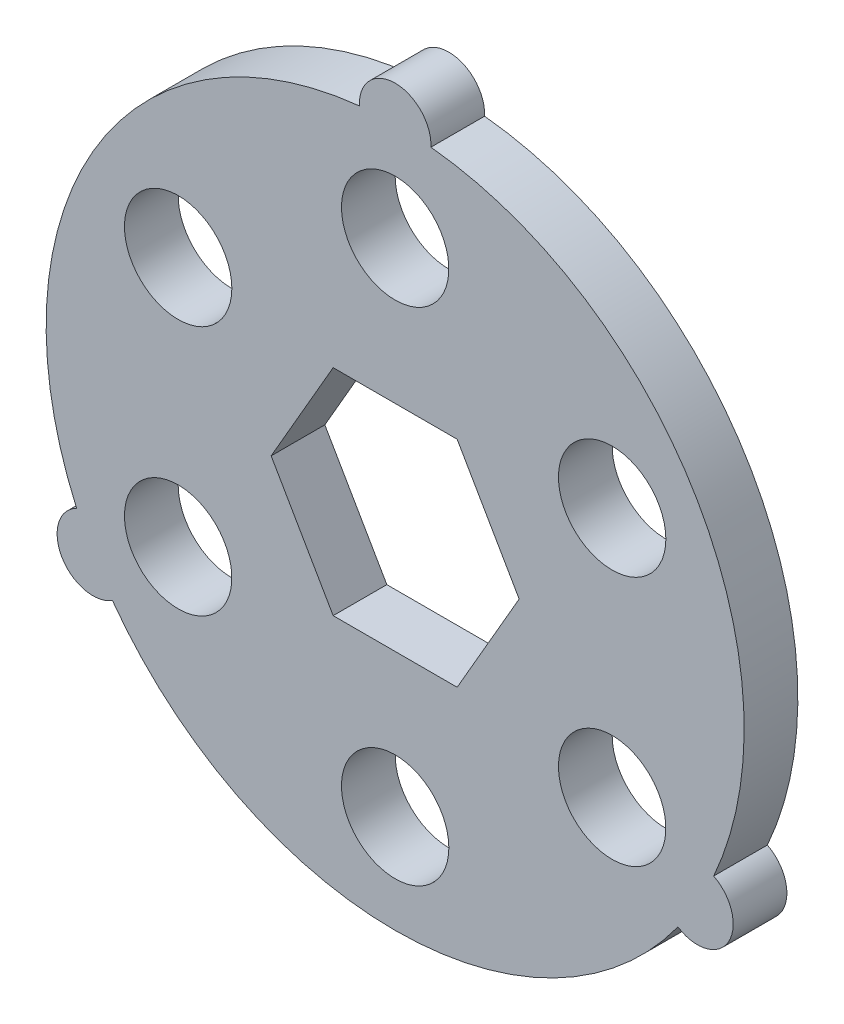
from build123d import *

# Parameters (mm, degrees)
ESQUISSE1_R                  = 9.75
BASE_EXTRUSION_DEPTH         = 0.75
ESQUISSE2_R                  = 1.5
ENL_V_MAT_EXTRU_1_DEPTH      = 14.869931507
R_P_TITION_CIRCULAIRE1_COUNT = 6
ESQUISSE3_R                  = 1
BOSS_EXTRU_1_DEPTH           = 1.5
R_P_TITION_CIRCULAIRE2_COUNT = 3


with BuildPart() as part:
    # Esquisse1 → Base-Extrusion (new, symmetric)
    with BuildSketch(Plane.XY):
        Circle(ESQUISSE1_R)
        Polygon((3.464101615, 0), (1.732050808, 3), (-1.732050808, 3), (-3.464101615, 0), (-1.732050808, -3), (1.732050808, -3), align=None, mode=Mode.SUBTRACT)
    extrude(amount=BASE_EXTRUSION_DEPTH, both=True)

    # Esquisse2 → Enl_v. mat.-Extru.1 (cut, through all)
    with BuildSketch(Plane.XY.offset(0.75)):
        with Locations((-6.062177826, 3.5)):
            Circle(ESQUISSE2_R)
    enl_v_mat_extru_1 = extrude(amount=-ENL_V_MAT_EXTRU_1_DEPTH, mode=Mode.SUBTRACT)

    # R_p_tition circulaire1: Enl_v. mat.-Extru.1 ×6 about axis
    r_p_tition_circulaire1_axis = Axis((0, 0, 0), (0, 0, 1))
    for i in range(1, R_P_TITION_CIRCULAIRE1_COUNT):
        add(enl_v_mat_extru_1.rotate(r_p_tition_circulaire1_axis, i * 360 / R_P_TITION_CIRCULAIRE1_COUNT), mode=Mode.SUBTRACT)

    # Esquisse3 → Boss.-Extru.1 (add)
    with BuildSketch(Plane.XY.offset(0.75)):
        with Locations((0, 9.75)):
            Circle(ESQUISSE3_R)
    boss_extru_1 = extrude(amount=-BOSS_EXTRU_1_DEPTH)

    # R_p_tition circulaire2: Boss.-Extru.1 ×3 about axis
    r_p_tition_circulaire2_axis = Axis((0, 0, 0), (0, 0, 1))
    for i in range(1, R_P_TITION_CIRCULAIRE2_COUNT):
        add(boss_extru_1.rotate(r_p_tition_circulaire2_axis, i * 360 / R_P_TITION_CIRCULAIRE2_COUNT))


solid = part.part
